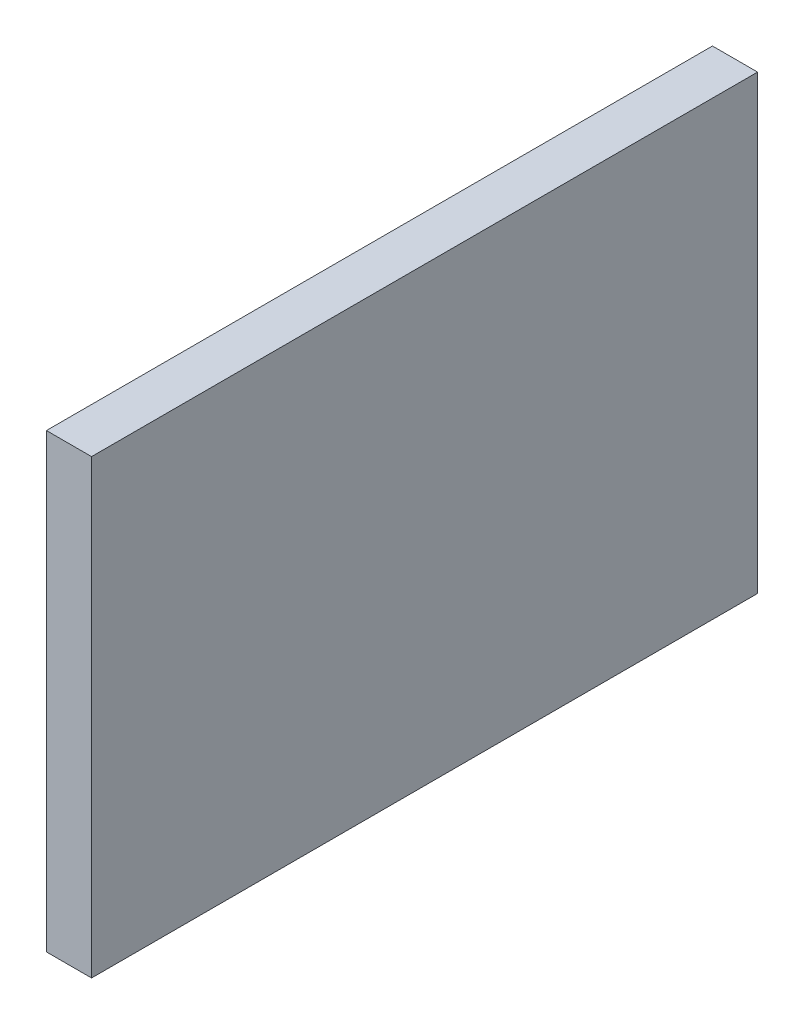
from build123d import *

# Parameters (mm, degrees)
SKETCH2_W           = 29.5
SKETCH2_H           = 20
BOSS_EXTRUDE1_DEPTH = 2


with BuildPart() as part:
    # Sketch2 → Boss-Extrude1 (new body)
    with BuildSketch(Plane(origin=(0, 0, 0), x_dir=(0, 0, -1), z_dir=(1, 0, 0))):
        with Locations((-0.336356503, 2.910763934)):
            Rectangle(SKETCH2_W, SKETCH2_H)
    extrude(amount=BOSS_EXTRUDE1_DEPTH)


solid = part.part
